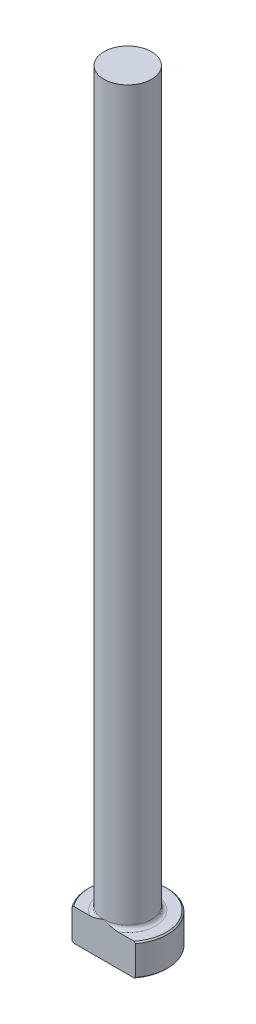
ISO-10303-21;
HEADER;
FILE_DESCRIPTION(('STEP AP214'),'2;1');
FILE_NAME('part.step','',(''),(''),'','','');
FILE_SCHEMA(('AUTOMOTIVE_DESIGN { 1 0 10303 214 1 1 1 1 }'));
ENDSEC;
DATA;
#1=APPLICATION_CONTEXT('core data for automotive mechanical design processes');
#2=APPLICATION_PROTOCOL_DEFINITION('international standard','automotive_design',2000,#1);
#3=PRODUCT_CONTEXT('',#1,'mechanical');
#4=PRODUCT('Part','Part','',(#3));
#5=PRODUCT_RELATED_PRODUCT_CATEGORY('part','',(#4));
#6=PRODUCT_DEFINITION_FORMATION('','',#4);
#7=PRODUCT_DEFINITION_CONTEXT('part definition',#1,'design');
#8=PRODUCT_DEFINITION('design','',#6,#7);
#9=PRODUCT_DEFINITION_SHAPE('','',#8);
#10=(LENGTH_UNIT() NAMED_UNIT(*) SI_UNIT(.MILLI.,.METRE.));
#11=(NAMED_UNIT(*) PLANE_ANGLE_UNIT() SI_UNIT($,.RADIAN.));
#12=(NAMED_UNIT(*) SI_UNIT($,.STERADIAN.) SOLID_ANGLE_UNIT());
#13=UNCERTAINTY_MEASURE_WITH_UNIT(LENGTH_MEASURE(1.E-05),#10,'distance_accuracy_value','');
#14=(GEOMETRIC_REPRESENTATION_CONTEXT(3) GLOBAL_UNCERTAINTY_ASSIGNED_CONTEXT((#13)) GLOBAL_UNIT_ASSIGNED_CONTEXT((#10,
#11,#12)) REPRESENTATION_CONTEXT('',''));
#15=CARTESIAN_POINT('',(0.,0.,0.));
#16=DIRECTION('',(0.,0.,1.));
#17=DIRECTION('',(1.,0.,0.));
#18=AXIS2_PLACEMENT_3D('',#15,#16,#17);
#19=CARTESIAN_POINT('',(0.,0.,0.));
#20=DIRECTION('',(0.,-1.,0.));
#21=DIRECTION('',(0.,0.,-1.));
#22=AXIS2_PLACEMENT_3D('',#19,#20,#21);
#23=PLANE('',#22);
#24=CARTESIAN_POINT('',(0.,0.,0.));
#25=DIRECTION('',(0.,-1.,0.));
#26=DIRECTION('',(0.,0.,-1.));
#27=AXIS2_PLACEMENT_3D('',#24,#25,#26);
#28=CIRCLE('',#27,7.68349999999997);
#29=CARTESIAN_POINT('',(-6.02949135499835,0.,4.76249999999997));
#30=VERTEX_POINT('',#29);
#31=CARTESIAN_POINT('',(6.02949135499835,0.,4.76249999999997));
#32=VERTEX_POINT('',#31);
#33=EDGE_CURVE('E98',#30,#32,#28,.T.);
#34=ORIENTED_EDGE('',*,*,#33,.T.);
#35=DIRECTION('',(-1.,0.,0.));
#36=VECTOR('',#35,1.);
#37=CARTESIAN_POINT('',(-6.34999999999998,0.,4.76249999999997));
#38=LINE('',#37,#36);
#39=EDGE_CURVE('E83',#32,#30,#38,.T.);
#40=ORIENTED_EDGE('',*,*,#39,.T.);
#41=EDGE_LOOP('',(#34,#40));
#42=FACE_BOUND('',#41,.T.);
#43=ADVANCED_FACE('F32',(#42),#23,.T.);
#44=CARTESIAN_POINT('',(0.,259.958771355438,0.));
#45=DIRECTION('',(0.,1.,0.));
#46=DIRECTION('',(0.,0.,1.));
#47=AXIS2_PLACEMENT_3D('',#44,#45,#46);
#48=CYLINDRICAL_SURFACE('',#47,7.93749999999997);
#49=CARTESIAN_POINT('',(0.,6.09600000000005,0.));
#50=DIRECTION('',(0.,1.,0.));
#51=DIRECTION('',(0.,0.,1.));
#52=AXIS2_PLACEMENT_3D('',#49,#50,#51);
#53=CIRCLE('',#52,7.93749999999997);
#54=CARTESIAN_POINT('',(-6.34999999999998,6.09600000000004,4.76249999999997));
#55=VERTEX_POINT('',#54);
#56=CARTESIAN_POINT('',(6.34999999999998,6.09600000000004,4.76249999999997));
#57=VERTEX_POINT('',#56);
#58=EDGE_CURVE('E104',#55,#57,#53,.F.);
#59=ORIENTED_EDGE('',*,*,#58,.T.);
#60=DIRECTION('',(0.,-1.,0.));
#61=VECTOR('',#60,1.);
#62=CARTESIAN_POINT('',(6.34999999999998,152.4,4.76249999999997));
#63=LINE('',#62,#61);
#64=CARTESIAN_POINT('',(6.34999999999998,0.253999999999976,4.76249999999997));
#65=VERTEX_POINT('',#64);
#66=EDGE_CURVE('E183',#57,#65,#63,.T.);
#67=ORIENTED_EDGE('',*,*,#66,.T.);
#68=CARTESIAN_POINT('',(0.,0.253999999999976,0.));
#69=DIRECTION('',(0.,-1.,0.));
#70=DIRECTION('',(0.,0.,-1.));
#71=AXIS2_PLACEMENT_3D('',#68,#69,#70);
#72=CIRCLE('',#71,7.93749999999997);
#73=CARTESIAN_POINT('',(-6.34999999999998,0.253999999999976,4.76249999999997));
#74=VERTEX_POINT('',#73);
#75=EDGE_CURVE('E100',#65,#74,#72,.F.);
#76=ORIENTED_EDGE('',*,*,#75,.T.);
#77=DIRECTION('',(0.,-1.,0.));
#78=VECTOR('',#77,1.);
#79=CARTESIAN_POINT('',(-6.34999999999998,152.4,4.76249999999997));
#80=LINE('',#79,#78);
#81=EDGE_CURVE('E93',#55,#74,#80,.T.);
#82=ORIENTED_EDGE('',*,*,#81,.F.);
#83=EDGE_LOOP('',(#59,#67,#76,#82));
#84=FACE_BOUND('',#83,.T.);
#85=ADVANCED_FACE('F158',(#84),#48,.T.);
#86=CARTESIAN_POINT('',(-7.93749999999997,6.35,0.));
#87=DIRECTION('',(0.,1.,0.));
#88=DIRECTION('',(0.,0.,1.));
#89=AXIS2_PLACEMENT_3D('',#86,#87,#88);
#90=PLANE('',#89);
#91=CARTESIAN_POINT('',(0.,6.35,0.));
#92=DIRECTION('',(0.,1.,0.));
#93=DIRECTION('',(0.,0.,1.));
#94=AXIS2_PLACEMENT_3D('',#91,#92,#93);
#95=CIRCLE('',#94,7.68350000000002);
#96=CARTESIAN_POINT('',(6.02949135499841,6.35,4.76249999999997));
#97=VERTEX_POINT('',#96);
#98=CARTESIAN_POINT('',(-6.02949135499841,6.35,4.76249999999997));
#99=VERTEX_POINT('',#98);
#100=EDGE_CURVE('E178',#97,#99,#95,.T.);
#101=ORIENTED_EDGE('',*,*,#100,.T.);
#102=DIRECTION('',(1.,0.,0.));
#103=VECTOR('',#102,1.);
#104=CARTESIAN_POINT('',(-7.93749999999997,6.35,4.76249999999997));
#105=LINE('',#104,#103);
#106=CARTESIAN_POINT('',(-2.79976677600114,6.35000000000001,4.76249999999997));
#107=VERTEX_POINT('',#106);
#108=EDGE_CURVE('E57',#99,#107,#105,.T.);
#109=ORIENTED_EDGE('',*,*,#108,.T.);
#110=CARTESIAN_POINT('',(0.,6.35,0.));
#111=DIRECTION('',(0.,1.,0.));
#112=DIRECTION('',(0.,0.,1.));
#113=AXIS2_PLACEMENT_3D('',#110,#111,#112);
#114=CIRCLE('',#113,5.52449999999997);
#115=CARTESIAN_POINT('',(2.79976677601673,6.35000000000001,4.76249999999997));
#116=VERTEX_POINT('',#115);
#117=EDGE_CURVE('E107',#107,#116,#114,.F.);
#118=ORIENTED_EDGE('',*,*,#117,.T.);
#119=EDGE_CURVE('E136',#116,#97,#105,.T.);
#120=ORIENTED_EDGE('',*,*,#119,.T.);
#121=EDGE_LOOP('',(#101,#109,#118,#120));
#122=FACE_BOUND('',#121,.T.);
#123=ADVANCED_FACE('F147',(#122),#90,.T.);
#124=CARTESIAN_POINT('',(0.,6.35000000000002,0.));
#125=DIRECTION('',(0.,-1.,0.));
#126=DIRECTION('',(0.,0.,-1.));
#127=AXIS2_PLACEMENT_3D('',#124,#125,#126);
#128=CONICAL_SURFACE('',#127,7.6835,0.785398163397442);
#129=ORIENTED_EDGE('',*,*,#58,.F.);
#130=CARTESIAN_POINT('',(-13.9717238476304,-0.727613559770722,4.76249999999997));
#131=CARTESIAN_POINT('',(-13.7440124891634,-0.512084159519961,4.76249999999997));
#132=CARTESIAN_POINT('',(-13.5160318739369,-0.296838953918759,4.76249999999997));
#133=CARTESIAN_POINT('',(-13.0594385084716,0.132982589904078,4.76249999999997));
#134=CARTESIAN_POINT('',(-12.8308257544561,0.347558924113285,4.76249999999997));
#135=CARTESIAN_POINT('',(-12.1433698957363,0.990628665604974,4.76249999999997));
#136=CARTESIAN_POINT('',(-11.683438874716,1.417960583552,4.76249999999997));
#137=CARTESIAN_POINT('',(-10.7398192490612,2.28660831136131,4.76249999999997));
#138=CARTESIAN_POINT('',(-10.2559580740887,2.72773732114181,4.76249999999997));
#139=CARTESIAN_POINT('',(-9.52579613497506,3.38404130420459,4.76249999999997));
#140=CARTESIAN_POINT('',(-9.28181372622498,3.60179461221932,4.76249999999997));
#141=CARTESIAN_POINT('',(-8.79195583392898,4.03515959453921,4.76249999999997));
#142=CARTESIAN_POINT('',(-8.54608036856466,4.25077128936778,4.76249999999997));
#143=CARTESIAN_POINT('',(-8.05235063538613,4.67899963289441,4.76249999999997));
#144=CARTESIAN_POINT('',(-7.80449972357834,4.89162014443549,4.76249999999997));
#145=CARTESIAN_POINT('',(-7.30587283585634,5.31343752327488,4.76249999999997));
#146=CARTESIAN_POINT('',(-7.05509670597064,5.52263420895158,4.76249999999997));
#147=CARTESIAN_POINT('',(-6.54895570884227,5.93726289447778,4.76249999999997));
#148=CARTESIAN_POINT('',(-6.29357776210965,6.14267898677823,4.76249999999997));
#149=CARTESIAN_POINT('',(-5.77806261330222,6.54738613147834,4.76249999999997));
#150=CARTESIAN_POINT('',(-5.51792616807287,6.74667814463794,4.76249999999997));
#151=CARTESIAN_POINT('',(-4.99669315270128,7.13290361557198,4.76249999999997));
#152=CARTESIAN_POINT('',(-4.7357228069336,7.3200056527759,4.76249999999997));
#153=CARTESIAN_POINT('',(-4.33820944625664,7.59205599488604,4.76249999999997));
#154=CARTESIAN_POINT('',(-4.20463607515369,7.68134253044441,4.76249999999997));
#155=CARTESIAN_POINT('',(-3.93520014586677,7.85638938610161,4.76249999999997));
#156=CARTESIAN_POINT('',(-3.79933771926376,7.94214990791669,4.76249999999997));
#157=CARTESIAN_POINT('',(-3.52582078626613,8.10887856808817,4.76249999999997));
#158=CARTESIAN_POINT('',(-3.38818211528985,8.18987258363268,4.76249999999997));
#159=CARTESIAN_POINT('',(-3.10994368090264,8.34667799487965,4.76249999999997));
#160=CARTESIAN_POINT('',(-2.96934354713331,8.42248873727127,4.76249999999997));
#161=CARTESIAN_POINT('',(-2.68509318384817,8.56758570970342,4.76249999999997));
#162=CARTESIAN_POINT('',(-2.54144841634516,8.63688258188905,4.76249999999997));
#163=CARTESIAN_POINT('',(-2.25062082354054,8.76758710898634,4.76249999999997));
#164=CARTESIAN_POINT('',(-2.10343915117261,8.8289972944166,4.76249999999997));
#165=CARTESIAN_POINT('',(-1.8843333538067,8.91218004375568,4.76249999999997));
#166=CARTESIAN_POINT('',(-1.81383186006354,8.93772120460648,4.76249999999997));
#167=CARTESIAN_POINT('',(-1.67202052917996,8.98645907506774,4.76249999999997));
#168=CARTESIAN_POINT('',(-1.60071065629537,9.00965568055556,4.76249999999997));
#169=CARTESIAN_POINT('',(-1.38555472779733,9.07542289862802,4.76249999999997));
#170=CARTESIAN_POINT('',(-1.24050522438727,9.11416209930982,4.76249999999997));
#171=CARTESIAN_POINT('',(-0.948515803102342,9.17953563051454,4.76249999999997));
#172=CARTESIAN_POINT('',(-0.801590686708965,9.20623542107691,4.76249999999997));
#173=CARTESIAN_POINT('',(-0.505930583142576,9.2464400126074,4.76249999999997));
#174=CARTESIAN_POINT('',(-0.357195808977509,9.25994635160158,4.76249999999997));
#175=CARTESIAN_POINT('',(-0.0580773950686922,9.27300540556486,4.76249999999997));
#176=CARTESIAN_POINT('',(0.0923105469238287,9.27246142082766,4.76249999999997));
#177=CARTESIAN_POINT('',(0.392354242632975,9.2572158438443,4.76249999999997));
#178=CARTESIAN_POINT('',(0.542009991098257,9.24251415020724,4.76249999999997));
#179=CARTESIAN_POINT('',(0.840076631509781,9.19973713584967,4.76249999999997));
#180=CARTESIAN_POINT('',(0.988478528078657,9.1716000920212,4.76249999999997));
#181=CARTESIAN_POINT('',(1.28250292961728,9.10341431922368,4.76249999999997));
#182=CARTESIAN_POINT('',(1.42812484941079,9.06336311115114,4.76249999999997));
#183=CARTESIAN_POINT('',(1.80157652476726,8.94630142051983,4.76249999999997));
#184=CARTESIAN_POINT('',(2.0269442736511,8.86145845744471,4.76249999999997));
#185=CARTESIAN_POINT('',(2.46947102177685,8.6725754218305,4.76249999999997));
#186=CARTESIAN_POINT('',(2.6866230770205,8.56851952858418,4.76249999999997));
#187=CARTESIAN_POINT('',(3.00782565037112,8.40144847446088,4.76249999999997));
#188=CARTESIAN_POINT('',(3.11463323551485,8.3436269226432,4.76249999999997));
#189=CARTESIAN_POINT('',(3.32653927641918,8.22492412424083,4.76249999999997));
#190=CARTESIAN_POINT('',(3.4316377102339,8.16404283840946,4.76249999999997));
#191=CARTESIAN_POINT('',(3.64022442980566,8.03970047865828,4.76249999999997));
#192=CARTESIAN_POINT('',(3.74371344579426,7.97624062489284,4.76249999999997));
#193=CARTESIAN_POINT('',(3.94927417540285,7.84708004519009,4.76249999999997));
#194=CARTESIAN_POINT('',(4.05134594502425,7.78137940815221,4.76249999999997));
#195=CARTESIAN_POINT('',(4.39010681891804,7.55875403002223,4.76249999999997));
#196=CARTESIAN_POINT('',(4.62396840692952,7.39752115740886,4.76249999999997));
#197=CARTESIAN_POINT('',(5.08629215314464,7.06746483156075,4.76249999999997));
#198=CARTESIAN_POINT('',(5.31475310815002,6.89863971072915,4.76249999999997));
#199=CARTESIAN_POINT('',(5.7675629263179,6.5552376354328,4.76249999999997));
#200=CARTESIAN_POINT('',(5.99190862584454,6.38065652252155,4.76249999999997));
#201=CARTESIAN_POINT('',(6.43717517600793,6.02723273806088,4.76249999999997));
#202=CARTESIAN_POINT('',(6.65809630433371,5.84839041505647,4.76249999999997));
#203=CARTESIAN_POINT('',(7.09790647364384,5.48680641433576,4.76249999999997));
#204=CARTESIAN_POINT('',(7.31678672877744,5.30405407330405,4.76249999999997));
#205=CARTESIAN_POINT('',(7.7523137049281,4.93590430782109,4.76249999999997));
#206=CARTESIAN_POINT('',(7.96896038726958,4.7505068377,4.76249999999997));
#207=CARTESIAN_POINT('',(8.4003252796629,4.37766695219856,4.76249999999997));
#208=CARTESIAN_POINT('',(8.61504426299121,4.19022543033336,4.76249999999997));
#209=CARTESIAN_POINT('',(9.04295707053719,3.81360841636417,4.76249999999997));
#210=CARTESIAN_POINT('',(9.25615088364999,3.62443291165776,4.76249999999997));
#211=CARTESIAN_POINT('',(9.85099823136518,3.09302727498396,4.76249999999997));
#212=CARTESIAN_POINT('',(10.2312296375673,2.74920552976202,4.76249999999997));
#213=CARTESIAN_POINT('',(10.9886755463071,2.0581727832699,4.76249999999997));
#214=CARTESIAN_POINT('',(11.3658896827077,1.71096138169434,4.76249999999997));
#215=CARTESIAN_POINT('',(12.1155837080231,1.0162434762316,4.76249999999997));
#216=CARTESIAN_POINT('',(12.4880784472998,0.668752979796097,4.76249999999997));
#217=CARTESIAN_POINT('',(13.2311819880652,-0.0281268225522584,4.76249999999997));
#218=CARTESIAN_POINT('',(13.6017910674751,-0.37751583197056,4.76249999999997));
#219=CARTESIAN_POINT('',(13.9717238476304,-0.727613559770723,4.76249999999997));
#220=B_SPLINE_CURVE_WITH_KNOTS('',3,(#130,#131,#132,#133,#134,#135,#136,#137,#138,#139,#140,
#141,#142,#143,#144,#145,#146,#147,#148,#149,#150,#151,#152,#153,#154,#155,#156,#157,#158,#159,
#160,#161,#162,#163,#164,#165,#166,#167,#168,#169,#170,#171,#172,#173,#174,#175,#176,#177,#178,
#179,#180,#181,#182,#183,#184,#185,#186,#187,#188,#189,#190,#191,#192,#193,#194,#195,#196,#197,
#198,#199,#200,#201,#202,#203,#204,#205,#206,#207,#208,#209,#210,#211,#212,#213,#214,#215,#216,
#217,#218,#219),.UNSPECIFIED.,.F.,.F.,(4,2,2,2,2,2,2,2,2,2,2,2,2,2,2,2,2,2,2,2,2,2,2,2,2,2,2,2,
2,2,2,2,2,2,2,2,2,2,2,2,2,2,2,2,4),(0.,0.940610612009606,1.88122685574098,3.76464908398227,
5.72889030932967,6.70994924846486,7.69099877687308,8.67063680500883,9.6503266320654,
10.6334769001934,11.616472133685,12.5795523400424,13.0615108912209,13.5434418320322,
14.0224542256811,14.5015268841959,14.9798027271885,15.457924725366,15.6828447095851,
15.9077746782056,16.3577079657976,16.8051644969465,17.2525688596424,17.7030532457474,
18.1535408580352,18.6061182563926,19.0587898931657,19.7799130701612,20.5016327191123,
20.8659558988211,21.2302837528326,21.5944411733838,21.9585841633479,22.8105074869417,
23.6626188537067,24.5153599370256,25.3680315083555,26.2234368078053,27.0788568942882,
27.9339169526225,28.788983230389,30.3268416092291,31.8648838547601,33.3931161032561,
34.9211161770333),.UNSPECIFIED.);
#221=EDGE_CURVE('E135',#55,#99,#220,.T.);
#222=ORIENTED_EDGE('',*,*,#221,.T.);
#223=ORIENTED_EDGE('',*,*,#100,.F.);
#224=EDGE_CURVE('E127',#97,#57,#220,.T.);
#225=ORIENTED_EDGE('',*,*,#224,.T.);
#226=EDGE_LOOP('',(#129,#222,#223,#225));
#227=FACE_BOUND('',#226,.T.);
#228=ADVANCED_FACE('F143',(#227),#128,.T.);
#229=CARTESIAN_POINT('',(0.,0.253999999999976,0.));
#230=DIRECTION('',(0.,1.,0.));
#231=DIRECTION('',(0.,0.,1.));
#232=AXIS2_PLACEMENT_3D('',#229,#230,#231);
#233=CONICAL_SURFACE('',#232,7.93749999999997,0.785398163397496);
#234=ORIENTED_EDGE('',*,*,#75,.F.);
#235=CARTESIAN_POINT('',(13.9717238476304,7.07761355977,4.76249999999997));
#236=CARTESIAN_POINT('',(13.7440124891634,6.86208415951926,4.76249999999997));
#237=CARTESIAN_POINT('',(13.5160318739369,6.64683895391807,4.76249999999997));
#238=CARTESIAN_POINT('',(13.0594385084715,6.21701741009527,4.76249999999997));
#239=CARTESIAN_POINT('',(12.8308257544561,6.00244107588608,4.76249999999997));
#240=CARTESIAN_POINT('',(12.1433698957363,5.35937133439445,4.76249999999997));
#241=CARTESIAN_POINT('',(11.6834388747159,4.93203941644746,4.76249999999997));
#242=CARTESIAN_POINT('',(10.7398192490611,4.06339168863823,4.76249999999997));
#243=CARTESIAN_POINT('',(10.2559580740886,3.62226267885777,4.76249999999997));
#244=CARTESIAN_POINT('',(9.52579613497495,2.96595869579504,4.76249999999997));
#245=CARTESIAN_POINT('',(9.28181372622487,2.74820538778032,4.76249999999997));
#246=CARTESIAN_POINT('',(8.79195583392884,2.31484040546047,4.76249999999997));
#247=CARTESIAN_POINT('',(8.54608036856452,2.09922871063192,4.76249999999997));
#248=CARTESIAN_POINT('',(8.05235063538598,1.67100036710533,4.76249999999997));
#249=CARTESIAN_POINT('',(7.80449972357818,1.45837985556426,4.76249999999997));
#250=CARTESIAN_POINT('',(7.30587283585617,1.03656247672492,4.76249999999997));
#251=CARTESIAN_POINT('',(7.05509670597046,0.827365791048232,4.76249999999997));
#252=CARTESIAN_POINT('',(6.54895570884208,0.412737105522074,4.76249999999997));
#253=CARTESIAN_POINT('',(6.29357776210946,0.207321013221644,4.76249999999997));
#254=CARTESIAN_POINT('',(5.77806261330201,-0.197386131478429,4.76249999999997));
#255=CARTESIAN_POINT('',(5.51792616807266,-0.396678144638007,4.76249999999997));
#256=CARTESIAN_POINT('',(4.99669315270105,-0.782903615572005,4.76249999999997));
#257=CARTESIAN_POINT('',(4.73572280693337,-0.970005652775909,4.76249999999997));
#258=CARTESIAN_POINT('',(4.3382094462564,-1.24205599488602,4.76249999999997));
#259=CARTESIAN_POINT('',(4.20463607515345,-1.33134253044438,4.76249999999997));
#260=CARTESIAN_POINT('',(3.93520014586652,-1.50638938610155,4.76249999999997));
#261=CARTESIAN_POINT('',(3.79933771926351,-1.59214990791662,4.76249999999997));
#262=CARTESIAN_POINT('',(3.52582078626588,-1.75887856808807,4.76249999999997));
#263=CARTESIAN_POINT('',(3.3881821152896,-1.83987258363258,4.76249999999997));
#264=CARTESIAN_POINT('',(3.10994368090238,-1.99667799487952,4.76249999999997));
#265=CARTESIAN_POINT('',(2.96934354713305,-2.07248873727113,4.76249999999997));
#266=CARTESIAN_POINT('',(2.68509318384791,-2.21758570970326,4.76249999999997));
#267=CARTESIAN_POINT('',(2.5414484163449,-2.28688258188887,4.76249999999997));
#268=CARTESIAN_POINT('',(2.25062082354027,-2.41758710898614,4.76249999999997));
#269=CARTESIAN_POINT('',(2.10343915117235,-2.47899729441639,4.76249999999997));
#270=CARTESIAN_POINT('',(1.88433335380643,-2.56218004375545,4.76249999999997));
#271=CARTESIAN_POINT('',(1.81383186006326,-2.58772120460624,4.76249999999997));
#272=CARTESIAN_POINT('',(1.67202052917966,-2.63645907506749,4.76249999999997));
#273=CARTESIAN_POINT('',(1.60071065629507,-2.65965568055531,4.76249999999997));
#274=CARTESIAN_POINT('',(1.38555472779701,-2.72542289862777,4.76249999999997));
#275=CARTESIAN_POINT('',(1.24050522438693,-2.76416209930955,4.76249999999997));
#276=CARTESIAN_POINT('',(0.94851580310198,-2.82953563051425,4.76249999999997));
#277=CARTESIAN_POINT('',(0.80159068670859,-2.85623542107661,4.76249999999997));
#278=CARTESIAN_POINT('',(0.505930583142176,-2.89644001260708,4.76249999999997));
#279=CARTESIAN_POINT('',(0.357195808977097,-2.90994635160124,4.76249999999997));
#280=CARTESIAN_POINT('',(0.0580773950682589,-2.9230054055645,4.76249999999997));
#281=CARTESIAN_POINT('',(-0.0923105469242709,-2.92246142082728,4.76249999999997));
#282=CARTESIAN_POINT('',(-0.392354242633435,-2.90721584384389,4.76249999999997));
#283=CARTESIAN_POINT('',(-0.542009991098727,-2.89251415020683,4.76249999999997));
#284=CARTESIAN_POINT('',(-0.840076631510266,-2.84973713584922,4.76249999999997));
#285=CARTESIAN_POINT('',(-0.988478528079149,-2.82160009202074,4.76249999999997));
#286=CARTESIAN_POINT('',(-1.28250292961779,-2.75341431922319,4.76249999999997));
#287=CARTESIAN_POINT('',(-1.42812484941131,-2.71336311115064,4.76249999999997));
#288=CARTESIAN_POINT('',(-1.80157652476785,-2.59630142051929,4.76249999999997));
#289=CARTESIAN_POINT('',(-2.02694427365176,-2.51145845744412,4.76249999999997));
#290=CARTESIAN_POINT('',(-2.46947102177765,-2.32257542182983,4.76249999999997));
#291=CARTESIAN_POINT('',(-2.68662307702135,-2.21851952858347,4.76249999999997));
#292=CARTESIAN_POINT('',(-3.00782565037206,-2.0514484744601,4.76249999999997));
#293=CARTESIAN_POINT('',(-3.11463323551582,-1.9936269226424,4.76249999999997));
#294=CARTESIAN_POINT('',(-3.32653927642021,-1.87492412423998,4.76249999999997));
#295=CARTESIAN_POINT('',(-3.43163771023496,-1.81404283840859,4.76249999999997));
#296=CARTESIAN_POINT('',(-3.64022442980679,-1.68970047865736,4.76249999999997));
#297=CARTESIAN_POINT('',(-3.74371344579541,-1.6262406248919,4.76249999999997));
#298=CARTESIAN_POINT('',(-3.94927417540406,-1.4970800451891,4.76249999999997));
#299=CARTESIAN_POINT('',(-4.05134594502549,-1.4313794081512,4.76249999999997));
#300=CARTESIAN_POINT('',(-4.39010681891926,-1.20875403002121,4.76249999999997));
#301=CARTESIAN_POINT('',(-4.6239684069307,-1.04752115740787,4.76249999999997));
#302=CARTESIAN_POINT('',(-5.08629215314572,-0.717464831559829,4.76249999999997));
#303=CARTESIAN_POINT('',(-5.31475310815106,-0.548639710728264,4.76249999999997));
#304=CARTESIAN_POINT('',(-5.76756292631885,-0.205237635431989,4.76249999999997));
#305=CARTESIAN_POINT('',(-5.99190862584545,-0.0306565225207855,4.76249999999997));
#306=CARTESIAN_POINT('',(-6.43717517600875,0.322767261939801,4.76249999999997));
#307=CARTESIAN_POINT('',(-6.65809630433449,0.501609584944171,4.76249999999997));
#308=CARTESIAN_POINT('',(-7.09790647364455,0.863193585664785,4.76249999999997));
#309=CARTESIAN_POINT('',(-7.3167867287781,1.04594592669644,4.76249999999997));
#310=CARTESIAN_POINT('',(-7.75231370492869,1.41409569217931,4.76249999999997));
#311=CARTESIAN_POINT('',(-7.96896038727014,1.59949316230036,4.76249999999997));
#312=CARTESIAN_POINT('',(-8.40032527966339,1.9723330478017,4.76249999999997));
#313=CARTESIAN_POINT('',(-8.61504426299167,2.15977456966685,4.76249999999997));
#314=CARTESIAN_POINT('',(-9.04295707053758,2.53639158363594,4.76249999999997));
#315=CARTESIAN_POINT('',(-9.25615088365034,2.72556708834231,4.76249999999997));
#316=CARTESIAN_POINT('',(-9.85099823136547,3.25697272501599,4.76249999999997));
#317=CARTESIAN_POINT('',(-10.2312296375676,3.60079447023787,4.76249999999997));
#318=CARTESIAN_POINT('',(-10.9886755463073,4.29182721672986,4.76249999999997));
#319=CARTESIAN_POINT('',(-11.3658896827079,4.63903861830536,4.76249999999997));
#320=CARTESIAN_POINT('',(-12.1155837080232,5.33375652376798,4.76249999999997));
#321=CARTESIAN_POINT('',(-12.4880784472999,5.68124702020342,4.76249999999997));
#322=CARTESIAN_POINT('',(-13.2311819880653,6.37812682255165,4.76249999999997));
#323=CARTESIAN_POINT('',(-13.6017910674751,6.72751583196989,4.76249999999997));
#324=CARTESIAN_POINT('',(-13.9717238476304,7.07761355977,4.76249999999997));
#325=B_SPLINE_CURVE_WITH_KNOTS('',3,(#235,#236,#237,#238,#239,#240,#241,#242,#243,#244,#245,
#246,#247,#248,#249,#250,#251,#252,#253,#254,#255,#256,#257,#258,#259,#260,#261,#262,#263,#264,
#265,#266,#267,#268,#269,#270,#271,#272,#273,#274,#275,#276,#277,#278,#279,#280,#281,#282,#283,
#284,#285,#286,#287,#288,#289,#290,#291,#292,#293,#294,#295,#296,#297,#298,#299,#300,#301,#302,
#303,#304,#305,#306,#307,#308,#309,#310,#311,#312,#313,#314,#315,#316,#317,#318,#319,#320,#321,
#322,#323,#324),.UNSPECIFIED.,.F.,.F.,(4,2,2,2,2,2,2,2,2,2,2,2,2,2,2,2,2,2,2,2,2,2,2,2,2,2,2,2,
2,2,2,2,2,2,2,2,2,2,2,2,2,2,2,2,4),(0.,0.94061061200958,1.88122685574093,3.76464908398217,
5.72889030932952,6.70994924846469,7.69099877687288,8.67063680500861,9.65032663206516,
10.6334769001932,11.6164721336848,12.5795523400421,13.0615108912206,13.5434418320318,
14.0224542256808,14.5015268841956,14.9798027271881,15.4579247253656,15.6828447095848,
15.9077746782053,16.3577079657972,16.8051644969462,17.2525688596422,17.7030532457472,
18.153540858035,18.6061182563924,19.0587898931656,19.7799130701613,20.5016327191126,
20.8659558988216,21.2302837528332,21.5944411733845,21.9585841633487,22.8105074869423,
23.6626188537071,24.5153599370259,25.3680315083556,26.2234368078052,27.078856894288,
27.933916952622,28.7889832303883,30.3268416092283,31.8648838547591,33.3931161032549,
34.9211161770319),.UNSPECIFIED.);
#326=EDGE_CURVE('E86',#65,#32,#325,.T.);
#327=ORIENTED_EDGE('',*,*,#326,.T.);
#328=ORIENTED_EDGE('',*,*,#33,.F.);
#329=EDGE_CURVE('E89',#30,#74,#325,.T.);
#330=ORIENTED_EDGE('',*,*,#329,.T.);
#331=EDGE_LOOP('',(#234,#327,#328,#330));
#332=FACE_BOUND('',#331,.T.);
#333=ADVANCED_FACE('F97',(#332),#233,.T.);
#334=CARTESIAN_POINT('',(0.,7.11200000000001,0.));
#335=DIRECTION('',(0.,1.,0.));
#336=DIRECTION('',(0.,0.,1.));
#337=AXIS2_PLACEMENT_3D('',#334,#335,#336);
#338=TOROIDAL_SURFACE('',#337,5.52449999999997,0.762);
#339=CARTESIAN_POINT('',(0.,7.11200000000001,4.76249999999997));
#340=CARTESIAN_POINT('',(1.75716832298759E-10,7.1120009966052,4.76249999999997));
#341=CARTESIAN_POINT('',(2.11716128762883E-07,7.11200199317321,4.76249999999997));
#342=CARTESIAN_POINT('',(8.80753956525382E-07,7.11200391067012,4.76249999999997));
#343=CARTESIAN_POINT('',(1.34491796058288E-06,7.11200482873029,4.76249999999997));
#344=CARTESIAN_POINT('',(2.45982947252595E-06,7.11200666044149,4.76249999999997));
#345=CARTESIAN_POINT('',(3.12384157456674E-06,7.11200756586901,4.76249999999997));
#346=CARTESIAN_POINT('',(4.55507944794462E-06,7.11200927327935,4.76249999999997));
#347=CARTESIAN_POINT('',(5.32136303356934E-06,7.11201007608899,4.76249999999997));
#348=CARTESIAN_POINT('',(8.07192926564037E-06,7.11201277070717,4.76249999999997));
#349=CARTESIAN_POINT('',(1.01901643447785E-05,7.11201452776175,4.76249999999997));
#350=CARTESIAN_POINT('',(1.45651591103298E-05,7.11201765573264,4.76249999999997));
#351=CARTESIAN_POINT('',(1.68139274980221E-05,7.11201903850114,4.76249999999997));
#352=CARTESIAN_POINT('',(2.56002968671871E-05,7.11202424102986,4.76249999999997));
#353=CARTESIAN_POINT('',(3.23057719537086E-05,7.11202779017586,4.76249999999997));
#354=CARTESIAN_POINT('',(4.55210144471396E-05,7.11203358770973,4.76249999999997));
#355=CARTESIAN_POINT('',(5.19929180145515E-05,7.11203592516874,4.76249999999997));
#356=CARTESIAN_POINT('',(7.95921607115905E-05,7.1120458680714,4.76249999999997));
#357=CARTESIAN_POINT('',(0.00010072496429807,7.11205341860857,4.76249999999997));
#358=CARTESIAN_POINT('',(0.000140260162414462,7.11206552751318,4.76249999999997));
#359=CARTESIAN_POINT('',(0.000158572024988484,7.11207036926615,4.76249999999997));
#360=CARTESIAN_POINT('',(0.000291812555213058,7.11210874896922,4.76249999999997));
#361=CARTESIAN_POINT('',(0.000401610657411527,7.11215771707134,4.76249999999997));
#362=CARTESIAN_POINT('',(0.00082873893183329,7.11234123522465,4.76249999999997));
#363=CARTESIAN_POINT('',(0.0011496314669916,7.11246431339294,4.76249999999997));
#364=CARTESIAN_POINT('',(0.00239628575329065,7.11294956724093,4.76249999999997));
#365=CARTESIAN_POINT('',(0.00331839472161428,7.11332376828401,4.76249999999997));
#366=CARTESIAN_POINT('',(0.00709602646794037,7.11484953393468,4.76249999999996));
#367=CARTESIAN_POINT('',(0.00995556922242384,7.11598757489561,4.76249999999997));
#368=CARTESIAN_POINT('',(0.0776380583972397,7.14293320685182,4.76250000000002));
#369=CARTESIAN_POINT('',(0.142407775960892,7.16892226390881,4.76249999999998));
#370=CARTESIAN_POINT('',(0.269647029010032,7.21961897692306,4.76249999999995));
#371=CARTESIAN_POINT('',(0.332112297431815,7.24433828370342,4.76249999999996));
#372=CARTESIAN_POINT('',(0.464537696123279,7.29630170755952,4.76249999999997));
#373=CARTESIAN_POINT('',(0.534515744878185,7.32350106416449,4.76249999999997));
#374=CARTESIAN_POINT('',(0.675480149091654,7.37742387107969,4.76249999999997));
#375=CARTESIAN_POINT('',(0.746469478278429,7.40413956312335,4.76249999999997));
#376=CARTESIAN_POINT('',(0.870073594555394,7.44962494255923,4.76249999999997));
#377=CARTESIAN_POINT('',(0.922600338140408,7.46863321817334,4.76249999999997));
#378=CARTESIAN_POINT('',(1.0277692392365,7.50591527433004,4.76249999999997));
#379=CARTESIAN_POINT('',(1.08041080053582,7.52419073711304,4.76249999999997));
#380=CARTESIAN_POINT('',(1.23635883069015,7.57699196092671,4.76249999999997));
#381=CARTESIAN_POINT('',(1.34005657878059,7.61037532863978,4.76249999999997));
#382=CARTESIAN_POINT('',(1.56359060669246,7.67746997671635,4.76249999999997));
#383=CARTESIAN_POINT('',(1.68362015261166,7.71054957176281,4.76249999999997));
#384=CARTESIAN_POINT('',(1.92642555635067,7.76967498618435,4.76249999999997));
#385=CARTESIAN_POINT('',(2.04921557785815,7.79566353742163,4.76249999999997));
#386=CARTESIAN_POINT('',(2.30422797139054,7.83918726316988,4.76249999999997));
#387=CARTESIAN_POINT('',(2.43656426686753,7.85610069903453,4.76249999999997));
#388=CARTESIAN_POINT('',(2.63563546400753,7.8702758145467,4.76249999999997));
#389=CARTESIAN_POINT('',(2.70197039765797,7.87313972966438,4.76249999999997));
#390=CARTESIAN_POINT('',(2.83467605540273,7.87452977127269,4.76249999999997));
#391=CARTESIAN_POINT('',(2.90104677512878,7.87305634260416,4.76249999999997));
#392=CARTESIAN_POINT('',(3.06624711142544,7.86305254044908,4.76249999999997));
#393=CARTESIAN_POINT('',(3.1649502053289,7.85140164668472,4.76249999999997));
#394=CARTESIAN_POINT('',(3.3102514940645,7.82310986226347,4.76249999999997));
#395=CARTESIAN_POINT('',(3.35793795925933,7.81197880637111,4.76249999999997));
#396=CARTESIAN_POINT('',(3.45215770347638,7.78564548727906,4.76249999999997));
#397=CARTESIAN_POINT('',(3.49869187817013,7.77044650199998,4.76249999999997));
#398=CARTESIAN_POINT('',(3.59306902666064,7.73421407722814,4.76249999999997));
#399=CARTESIAN_POINT('',(3.64079022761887,7.71285751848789,4.76249999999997));
#400=CARTESIAN_POINT('',(3.73313951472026,7.66398014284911,4.76249999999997));
#401=CARTESIAN_POINT('',(3.77776331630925,7.63645100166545,4.76249999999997));
#402=CARTESIAN_POINT('',(3.8538778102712,7.58041326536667,4.76249999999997));
#403=CARTESIAN_POINT('',(3.88624519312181,7.55310714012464,4.76249999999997));
#404=CARTESIAN_POINT('',(3.94622799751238,7.49369496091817,4.76249999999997));
#405=CARTESIAN_POINT('',(3.97385320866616,7.46159905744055,4.76249999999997));
#406=CARTESIAN_POINT('',(4.01655184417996,7.4011650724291,4.76249999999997));
#407=CARTESIAN_POINT('',(4.03304226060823,7.37383278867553,4.76249999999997));
#408=CARTESIAN_POINT('',(4.06135260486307,7.31682811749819,4.76249999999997));
#409=CARTESIAN_POINT('',(4.07317539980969,7.28715718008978,4.76249999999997));
#410=CARTESIAN_POINT('',(4.09136459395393,7.22592510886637,4.76249999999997));
#411=CARTESIAN_POINT('',(4.09769076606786,7.19435181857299,4.76249999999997));
#412=CARTESIAN_POINT('',(4.10417375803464,7.13057793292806,4.76249999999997));
#413=CARTESIAN_POINT('',(4.10433369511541,7.0983776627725,4.76249999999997));
#414=CARTESIAN_POINT('',(4.09881588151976,7.03816798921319,4.76249999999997));
#415=CARTESIAN_POINT('',(4.09379438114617,7.01009545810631,4.76249999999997));
#416=CARTESIAN_POINT('',(4.07925766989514,6.95514890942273,4.76249999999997));
#417=CARTESIAN_POINT('',(4.06974176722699,6.92827507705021,4.76249999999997));
#418=CARTESIAN_POINT('',(4.04639465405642,6.87537805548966,4.76249999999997));
#419=CARTESIAN_POINT('',(4.03242569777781,6.84941634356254,4.76249999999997));
#420=CARTESIAN_POINT('',(4.00102190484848,6.79970293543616,4.76249999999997));
#421=CARTESIAN_POINT('',(3.98358563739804,6.77595215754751,4.76249999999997));
#422=CARTESIAN_POINT('',(3.93494606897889,6.71761387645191,4.76249999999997));
#423=CARTESIAN_POINT('',(3.90164076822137,6.68477550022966,4.76249999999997));
#424=CARTESIAN_POINT('',(3.83023707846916,6.62476083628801,4.76249999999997));
#425=CARTESIAN_POINT('',(3.79212391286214,6.59760272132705,4.76249999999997));
#426=CARTESIAN_POINT('',(3.69123876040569,6.53519525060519,4.76249999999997));
#427=CARTESIAN_POINT('',(3.62627547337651,6.5035096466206,4.76249999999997));
#428=CARTESIAN_POINT('',(3.49255240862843,6.45041788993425,4.76249999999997));
#429=CARTESIAN_POINT('',(3.42379589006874,6.42900306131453,4.76249999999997));
#430=CARTESIAN_POINT('',(3.29415895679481,6.39697273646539,4.76249999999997));
#431=CARTESIAN_POINT('',(3.23354049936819,6.38525800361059,4.76249999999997));
#432=CARTESIAN_POINT('',(3.11149484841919,6.36705546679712,4.76249999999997));
#433=CARTESIAN_POINT('',(3.05006701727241,6.36057206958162,4.76249999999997));
#434=CARTESIAN_POINT('',(2.92589148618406,6.35201311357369,4.76249999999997));
#435=CARTESIAN_POINT('',(2.86313887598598,6.35001297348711,4.76249999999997));
#436=CARTESIAN_POINT('',(2.73768820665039,6.34998716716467,4.76249999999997));
#437=CARTESIAN_POINT('',(2.67499013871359,6.35195889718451,4.76249999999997));
#438=CARTESIAN_POINT('',(2.52932457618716,6.3605299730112,4.76249999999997));
#439=CARTESIAN_POINT('',(2.44643477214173,6.36843196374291,4.76249999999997));
#440=CARTESIAN_POINT('',(2.28127175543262,6.38922870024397,4.76249999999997));
#441=CARTESIAN_POINT('',(2.19899884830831,6.40212577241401,4.76249999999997));
#442=CARTESIAN_POINT('',(1.95269348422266,6.44712458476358,4.76249999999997));
#443=CARTESIAN_POINT('',(1.78980549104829,6.48548332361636,4.76249999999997));
#444=CARTESIAN_POINT('',(1.48033682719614,6.56994207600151,4.76249999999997));
#445=CARTESIAN_POINT('',(1.33350347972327,6.61516405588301,4.76249999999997));
#446=CARTESIAN_POINT('',(1.04345459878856,6.71161170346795,4.76249999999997));
#447=CARTESIAN_POINT('',(0.90021766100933,6.76277370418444,4.76249999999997));
#448=CARTESIAN_POINT('',(0.704750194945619,6.83559047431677,4.76249999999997));
#449=CARTESIAN_POINT('',(0.651886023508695,6.85558735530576,4.76249999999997));
#450=CARTESIAN_POINT('',(0.544940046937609,6.89652727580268,4.76249999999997));
#451=CARTESIAN_POINT('',(0.490862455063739,6.91748138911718,4.76249999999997));
#452=CARTESIAN_POINT('',(0.39954559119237,6.95317215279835,4.76249999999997));
#453=CARTESIAN_POINT('',(0.362273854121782,6.9678263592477,4.76249999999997));
#454=CARTESIAN_POINT('',(0.288146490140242,6.99710466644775,4.76249999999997));
#455=CARTESIAN_POINT('',(0.251290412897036,7.01172761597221,4.76249999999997));
#456=CARTESIAN_POINT('',(0.181451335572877,7.03949988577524,4.76249999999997));
#457=CARTESIAN_POINT('',(0.148465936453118,7.05264357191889,4.76249999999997));
#458=CARTESIAN_POINT('',(0.0812672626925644,7.07951218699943,4.76249999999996));
#459=CARTESIAN_POINT('',(0.047055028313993,7.09324020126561,4.76249999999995));
#460=CARTESIAN_POINT('',(0.00995870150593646,7.10801136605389,4.76249999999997));
#461=CARTESIAN_POINT('',(0.00710220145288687,7.10914804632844,4.76249999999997));
#462=CARTESIAN_POINT('',(0.00332530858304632,7.11067346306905,4.76249999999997));
#463=CARTESIAN_POINT('',(0.00240087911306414,7.11104861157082,4.76249999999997));
#464=CARTESIAN_POINT('',(0.00115127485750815,7.11153501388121,4.76249999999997));
#465=CARTESIAN_POINT('',(0.000829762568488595,7.11165833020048,4.76249999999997));
#466=CARTESIAN_POINT('',(0.000401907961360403,7.11184216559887,4.76249999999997));
#467=CARTESIAN_POINT('',(0.000291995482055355,7.11189118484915,4.76249999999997));
#468=CARTESIAN_POINT('',(0.000158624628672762,7.11192959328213,4.76249999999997));
#469=CARTESIAN_POINT('',(0.000140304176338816,7.11193443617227,4.76249999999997));
#470=CARTESIAN_POINT('',(0.000100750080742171,7.11194655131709,4.76249999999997));
#471=CARTESIAN_POINT('',(7.96072019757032E-05,7.11195410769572,4.76249999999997));
#472=CARTESIAN_POINT('',(5.19966523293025E-05,7.11196405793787,4.76249999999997));
#473=CARTESIAN_POINT('',(4.55234098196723E-05,7.111966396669,4.76249999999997));
#474=CARTESIAN_POINT('',(3.23056444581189E-05,7.11197219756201,4.76249999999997));
#475=CARTESIAN_POINT('',(2.55990344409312E-05,7.1119757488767,4.76249999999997));
#476=CARTESIAN_POINT('',(1.68115970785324E-05,7.11198095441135,4.76249999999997));
#477=CARTESIAN_POINT('',(1.45627239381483E-05,7.11198233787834,4.76249999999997));
#478=CARTESIAN_POINT('',(1.0187658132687E-05,7.11198546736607,4.76249999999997));
#479=CARTESIAN_POINT('',(8.06946385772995E-06,7.11198722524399,4.76249999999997));
#480=CARTESIAN_POINT('',(5.31911933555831E-06,7.11198992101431,4.76249999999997));
#481=CARTESIAN_POINT('',(4.55293264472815E-06,7.11199072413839,4.76249999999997));
#482=CARTESIAN_POINT('',(3.1219448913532E-06,7.11199243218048,4.76249999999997));
#483=CARTESIAN_POINT('',(2.45808665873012E-06,7.11199333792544,4.76249999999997));
#484=CARTESIAN_POINT('',(1.34354728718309E-06,7.11199517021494,4.76249999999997));
#485=CARTESIAN_POINT('',(8.79593870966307E-07,7.11199608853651,4.76249999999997));
#486=CARTESIAN_POINT('',(2.11067517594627E-07,7.11199800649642,4.76249999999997));
#487=CARTESIAN_POINT('',(-1.75739402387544E-10,7.11199900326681,4.76249999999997));
#488=CARTESIAN_POINT('',(0.,7.11200000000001,4.76249999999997));
#489=B_SPLINE_CURVE_WITH_KNOTS('',3,(#339,#340,#341,#342,#343,#344,#345,#346,#347,#348,#349,
#350,#351,#352,#353,#354,#355,#356,#357,#358,#359,#360,#361,#362,#363,#364,#365,#366,#367,#368,
#369,#370,#371,#372,#373,#374,#375,#376,#377,#378,#379,#380,#381,#382,#383,#384,#385,#386,#387,
#388,#389,#390,#391,#392,#393,#394,#395,#396,#397,#398,#399,#400,#401,#402,#403,#404,#405,#406,
#407,#408,#409,#410,#411,#412,#413,#414,#415,#416,#417,#418,#419,#420,#421,#422,#423,#424,#425,
#426,#427,#428,#429,#430,#431,#432,#433,#434,#435,#436,#437,#438,#439,#440,#441,#442,#443,#444,
#445,#446,#447,#448,#449,#450,#451,#452,#453,#454,#455,#456,#457,#458,#459,#460,#461,#462,#463,
#464,#465,#466,#467,#468,#469,#470,#471,#472,#473,#474,#475,#476,#477,#478,#479,#480,#481,#482,
#483,#484,#485,#486,#487,#488),.UNSPECIFIED.,.T.,.F.,(4,2,2,2,2,2,2,2,2,2,2,2,2,2,2,2,2,2,2,2,2,
2,2,2,2,2,2,2,2,2,2,2,2,2,2,2,2,2,2,2,2,2,2,2,2,2,2,2,2,2,2,2,2,2,2,2,2,2,2,2,2,2,2,2,2,2,2,2,2,
2,2,2,2,2,4),(0.,2.98829250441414E-06,6.05956346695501E-06,9.41423009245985E-06,
1.27398874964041E-05,2.09563298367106E-05,2.88697100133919E-05,5.15590449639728E-05,
7.21804383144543E-05,0.000139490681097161,0.00019626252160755,0.000555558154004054,
0.00158774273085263,0.00457176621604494,0.0138062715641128,0.223151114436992,0.424691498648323,
0.649921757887,0.877465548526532,1.0450421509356,1.21220902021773,1.53896422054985,
1.91230059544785,2.28856838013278,2.68809156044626,2.8871575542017,3.08620313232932,
3.38336261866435,3.53012668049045,3.67677283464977,3.83326124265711,3.98996197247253,
4.11658185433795,4.24293711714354,4.33833631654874,4.4336768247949,4.52970934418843,
4.62569331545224,4.710853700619,4.79602719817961,4.88414369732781,4.97229663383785,
5.11181296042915,5.25176903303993,5.46739168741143,5.68283187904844,5.86779164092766,
6.05290704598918,6.24111386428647,6.42919734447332,6.67879819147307,6.92851542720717,
7.42983936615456,7.89058054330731,8.34677385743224,8.51633402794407,8.69031772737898,
8.81046509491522,8.92941700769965,9.03594279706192,9.14652227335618,9.15574682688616,
9.15873836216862,9.15977254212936,9.16013221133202,9.16018900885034,9.16025635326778,
9.16027697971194,9.16029967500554,9.16030758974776,9.16031580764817,9.16031913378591,
9.1603224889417,9.16032556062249,9.16032854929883),.UNSPECIFIED.);
#490=CARTESIAN_POINT('',(0.,7.11200000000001,4.76249999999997));
#491=VERTEX_POINT('',#490);
#492=EDGE_CURVE('E11',#116,#491,#489,.T.);
#493=ORIENTED_EDGE('',*,*,#492,.F.);
#494=ORIENTED_EDGE('',*,*,#117,.F.);
#495=CARTESIAN_POINT('',(0.,7.11200000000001,4.76249999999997));
#496=CARTESIAN_POINT('',(-1.75715613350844E-10,7.11199900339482,4.76249999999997));
#497=CARTESIAN_POINT('',(-2.11716126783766E-07,7.11199800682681,4.76249999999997));
#498=CARTESIAN_POINT('',(-8.80753953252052E-07,7.1119960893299,4.76249999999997));
#499=CARTESIAN_POINT('',(-1.34491795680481E-06,7.11199517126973,4.76249999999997));
#500=CARTESIAN_POINT('',(-2.45982946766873E-06,7.11199333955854,4.76249999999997));
#501=CARTESIAN_POINT('',(-3.12384156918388E-06,7.11199243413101,4.76249999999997));
#502=CARTESIAN_POINT('',(-4.55507944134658E-06,7.11199072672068,4.76249999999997));
#503=CARTESIAN_POINT('',(-5.32136302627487E-06,7.11198992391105,4.76249999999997));
#504=CARTESIAN_POINT('',(-8.07192925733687E-06,7.11198722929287,4.76249999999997));
#505=CARTESIAN_POINT('',(-1.01901643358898E-05,7.11198547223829,4.76249999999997));
#506=CARTESIAN_POINT('',(-1.45651590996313E-05,7.1119823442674,4.76249999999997));
#507=CARTESIAN_POINT('',(-1.68139274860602E-05,7.1119809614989,4.76249999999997));
#508=CARTESIAN_POINT('',(-2.56002968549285E-05,7.11197575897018,4.76249999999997));
#509=CARTESIAN_POINT('',(-3.23057719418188E-05,7.11197220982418,4.76249999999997));
#510=CARTESIAN_POINT('',(-4.55210144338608E-05,7.11196641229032,4.76249999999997));
#511=CARTESIAN_POINT('',(-5.19929179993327E-05,7.11196407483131,4.76249999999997));
#512=CARTESIAN_POINT('',(-7.95921607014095E-05,7.11195413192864,4.76249999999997));
#513=CARTESIAN_POINT('',(-0.000100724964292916,7.11194658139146,4.76249999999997));
#514=CARTESIAN_POINT('',(-0.000140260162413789,7.11193447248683,4.76249999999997));
#515=CARTESIAN_POINT('',(-0.00015857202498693,7.11192963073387,4.76249999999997));
#516=CARTESIAN_POINT('',(-0.000291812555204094,7.11189125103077,4.76249999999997));
#517=CARTESIAN_POINT('',(-0.000401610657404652,7.11184228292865,4.76249999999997));
#518=CARTESIAN_POINT('',(-0.000828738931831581,7.11165876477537,4.76249999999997));
#519=CARTESIAN_POINT('',(-0.00114963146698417,7.11153568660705,4.76249999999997));
#520=CARTESIAN_POINT('',(-0.00239628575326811,7.11105043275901,4.76249999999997));
#521=CARTESIAN_POINT('',(-0.00331839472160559,7.11067623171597,4.76249999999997));
#522=CARTESIAN_POINT('',(-0.00709602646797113,7.10915046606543,4.76249999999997));
#523=CARTESIAN_POINT('',(-0.00995556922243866,7.10801242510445,4.76249999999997));
#524=CARTESIAN_POINT('',(-0.0776380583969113,7.08106679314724,4.76249999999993));
#525=CARTESIAN_POINT('',(-0.142407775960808,7.05507773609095,4.76249999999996));
#526=CARTESIAN_POINT('',(-0.269647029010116,7.0043810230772,4.76249999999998));
#527=CARTESIAN_POINT('',(-0.332112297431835,6.97966171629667,4.76249999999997));
#528=CARTESIAN_POINT('',(-0.464537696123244,6.92769829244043,4.76249999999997));
#529=CARTESIAN_POINT('',(-0.534515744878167,6.90049893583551,4.76249999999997));
#530=CARTESIAN_POINT('',(-0.675480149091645,6.84657612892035,4.76249999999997));
#531=CARTESIAN_POINT('',(-0.746469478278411,6.81986043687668,4.76249999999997));
#532=CARTESIAN_POINT('',(-0.87007359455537,6.77437505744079,4.76249999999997));
#533=CARTESIAN_POINT('',(-0.922600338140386,6.75536678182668,4.76249999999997));
#534=CARTESIAN_POINT('',(-1.02776923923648,6.71808472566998,4.76249999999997));
#535=CARTESIAN_POINT('',(-1.08041080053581,6.69980926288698,4.76249999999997));
#536=CARTESIAN_POINT('',(-1.23635883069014,6.64700803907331,4.76249999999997));
#537=CARTESIAN_POINT('',(-1.34005657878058,6.61362467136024,4.76249999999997));
#538=CARTESIAN_POINT('',(-1.56359060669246,6.54653002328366,4.76249999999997));
#539=CARTESIAN_POINT('',(-1.68362015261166,6.51345042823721,4.76249999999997));
#540=CARTESIAN_POINT('',(-1.92642555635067,6.45432501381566,4.76249999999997));
#541=CARTESIAN_POINT('',(-2.04921557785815,6.42833646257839,4.76249999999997));
#542=CARTESIAN_POINT('',(-2.30422797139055,6.38481273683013,4.76249999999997));
#543=CARTESIAN_POINT('',(-2.43656426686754,6.36789930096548,4.76249999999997));
#544=CARTESIAN_POINT('',(-2.63563546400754,6.35372418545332,4.76249999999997));
#545=CARTESIAN_POINT('',(-2.70197039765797,6.35086027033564,4.76249999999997));
#546=CARTESIAN_POINT('',(-2.83467605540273,6.34947022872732,4.76249999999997));
#547=CARTESIAN_POINT('',(-2.90104677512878,6.35094365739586,4.76249999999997));
#548=CARTESIAN_POINT('',(-3.06624711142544,6.36094745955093,4.76249999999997));
#549=CARTESIAN_POINT('',(-3.1649502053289,6.37259835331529,4.76249999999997));
#550=CARTESIAN_POINT('',(-3.3102514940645,6.40089013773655,4.76249999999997));
#551=CARTESIAN_POINT('',(-3.35793795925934,6.4120211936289,4.76249999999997));
#552=CARTESIAN_POINT('',(-3.45215770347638,6.43835451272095,4.76249999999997));
#553=CARTESIAN_POINT('',(-3.49869187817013,6.45355349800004,4.76249999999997));
#554=CARTESIAN_POINT('',(-3.59306902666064,6.48978592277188,4.76249999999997));
#555=CARTESIAN_POINT('',(-3.64079022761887,6.51114248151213,4.76249999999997));
#556=CARTESIAN_POINT('',(-3.73313951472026,6.56001985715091,4.76249999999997));
#557=CARTESIAN_POINT('',(-3.77776331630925,6.58754899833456,4.76249999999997));
#558=CARTESIAN_POINT('',(-3.8538778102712,6.64358673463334,4.76249999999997));
#559=CARTESIAN_POINT('',(-3.88624519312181,6.67089285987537,4.76249999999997));
#560=CARTESIAN_POINT('',(-3.94622799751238,6.73030503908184,4.76249999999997));
#561=CARTESIAN_POINT('',(-3.97385320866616,6.76240094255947,4.76249999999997));
#562=CARTESIAN_POINT('',(-4.01655184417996,6.82283492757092,4.76249999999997));
#563=CARTESIAN_POINT('',(-4.03304226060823,6.85016721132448,4.76249999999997));
#564=CARTESIAN_POINT('',(-4.06135260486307,6.90717188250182,4.76249999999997));
#565=CARTESIAN_POINT('',(-4.07317539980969,6.93684281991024,4.76249999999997));
#566=CARTESIAN_POINT('',(-4.09136459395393,6.99807489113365,4.76249999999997));
#567=CARTESIAN_POINT('',(-4.09769076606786,7.02964818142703,4.76249999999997));
#568=CARTESIAN_POINT('',(-4.10417375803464,7.09342206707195,4.76249999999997));
#569=CARTESIAN_POINT('',(-4.10433369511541,7.12562233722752,4.76249999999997));
#570=CARTESIAN_POINT('',(-4.09881588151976,7.18583201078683,4.76249999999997));
#571=CARTESIAN_POINT('',(-4.09379438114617,7.21390454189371,4.76249999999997));
#572=CARTESIAN_POINT('',(-4.07925766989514,7.26885109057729,4.76249999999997));
#573=CARTESIAN_POINT('',(-4.06974176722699,7.29572492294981,4.76249999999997));
#574=CARTESIAN_POINT('',(-4.04639465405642,7.34862194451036,4.76249999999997));
#575=CARTESIAN_POINT('',(-4.03242569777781,7.37458365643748,4.76249999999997));
#576=CARTESIAN_POINT('',(-4.00102190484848,7.42429706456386,4.76249999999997));
#577=CARTESIAN_POINT('',(-3.98358563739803,7.44804784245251,4.76249999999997));
#578=CARTESIAN_POINT('',(-3.93494606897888,7.50638612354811,4.76249999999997));
#579=CARTESIAN_POINT('',(-3.90164076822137,7.53922449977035,4.76249999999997));
#580=CARTESIAN_POINT('',(-3.83023707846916,7.599239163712,4.76249999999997));
#581=CARTESIAN_POINT('',(-3.79212391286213,7.62639727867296,4.76249999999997));
#582=CARTESIAN_POINT('',(-3.69123876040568,7.68880474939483,4.76249999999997));
#583=CARTESIAN_POINT('',(-3.62627547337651,7.72049035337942,4.76249999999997));
#584=CARTESIAN_POINT('',(-3.49255240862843,7.77358211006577,4.76249999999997));
#585=CARTESIAN_POINT('',(-3.42379589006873,7.79499693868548,4.76249999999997));
#586=CARTESIAN_POINT('',(-3.29415895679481,7.82702726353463,4.76249999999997));
#587=CARTESIAN_POINT('',(-3.23354049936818,7.83874199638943,4.76249999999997));
#588=CARTESIAN_POINT('',(-3.11149484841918,7.85694453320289,4.76249999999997));
#589=CARTESIAN_POINT('',(-3.0500670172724,7.86342793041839,4.76249999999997));
#590=CARTESIAN_POINT('',(-2.92589148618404,7.87198688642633,4.76249999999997));
#591=CARTESIAN_POINT('',(-2.86313887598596,7.87398702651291,4.76249999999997));
#592=CARTESIAN_POINT('',(-2.73768820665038,7.87401283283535,4.76249999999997));
#593=CARTESIAN_POINT('',(-2.67499013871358,7.87204110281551,4.76249999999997));
#594=CARTESIAN_POINT('',(-2.52932457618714,7.86347002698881,4.76249999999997));
#595=CARTESIAN_POINT('',(-2.44643477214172,7.8555680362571,4.76249999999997));
#596=CARTESIAN_POINT('',(-2.28127175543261,7.83477129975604,4.76249999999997));
#597=CARTESIAN_POINT('',(-2.1989988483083,7.821874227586,4.76249999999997));
#598=CARTESIAN_POINT('',(-1.95269348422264,7.77687541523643,4.76249999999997));
#599=CARTESIAN_POINT('',(-1.78980549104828,7.73851667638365,4.76249999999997));
#600=CARTESIAN_POINT('',(-1.48033682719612,7.6540579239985,4.76249999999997));
#601=CARTESIAN_POINT('',(-1.33350347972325,7.608835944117,4.76249999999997));
#602=CARTESIAN_POINT('',(-1.04345459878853,7.51238829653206,4.76249999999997));
#603=CARTESIAN_POINT('',(-0.900217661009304,7.46122629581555,4.76249999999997));
#604=CARTESIAN_POINT('',(-0.704750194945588,7.38840952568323,4.76249999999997));
#605=CARTESIAN_POINT('',(-0.651886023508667,7.36841264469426,4.76249999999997));
#606=CARTESIAN_POINT('',(-0.544940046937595,7.32747272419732,4.76249999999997));
#607=CARTESIAN_POINT('',(-0.490862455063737,7.30651861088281,4.76249999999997));
#608=CARTESIAN_POINT('',(-0.399545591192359,7.27082784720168,4.76249999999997));
#609=CARTESIAN_POINT('',(-0.362273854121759,7.25617364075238,4.76249999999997));
#610=CARTESIAN_POINT('',(-0.288146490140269,7.2268953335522,4.76249999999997));
#611=CARTESIAN_POINT('',(-0.251290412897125,7.21227238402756,4.76249999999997));
#612=CARTESIAN_POINT('',(-0.181451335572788,7.184500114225,4.76249999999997));
#613=CARTESIAN_POINT('',(-0.148465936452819,7.17135642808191,4.76249999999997));
#614=CARTESIAN_POINT('',(-0.0812672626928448,7.14448781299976,4.76249999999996));
#615=CARTESIAN_POINT('',(-0.0470550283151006,7.13075979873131,4.76249999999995));
#616=CARTESIAN_POINT('',(-0.00995870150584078,7.11598863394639,4.76249999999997));
#617=CARTESIAN_POINT('',(-0.00710220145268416,7.11485195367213,4.76249999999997));
#618=CARTESIAN_POINT('',(-0.00332530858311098,7.11332653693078,4.76249999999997));
#619=CARTESIAN_POINT('',(-0.00240087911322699,7.11295138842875,4.76249999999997));
#620=CARTESIAN_POINT('',(-0.00115127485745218,7.11246498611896,4.76249999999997));
#621=CARTESIAN_POINT('',(-0.000829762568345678,7.11234166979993,4.76249999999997));
#622=CARTESIAN_POINT('',(-0.00040190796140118,7.11215783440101,4.76249999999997));
#623=CARTESIAN_POINT('',(-0.000291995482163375,7.11210881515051,4.76249999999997));
#624=CARTESIAN_POINT('',(-0.000158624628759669,7.11207040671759,4.76249999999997));
#625=CARTESIAN_POINT('',(-0.000140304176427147,7.11206556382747,4.76249999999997));
#626=CARTESIAN_POINT('',(-0.000100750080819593,7.1120534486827,4.76249999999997));
#627=CARTESIAN_POINT('',(-7.96072020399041E-05,7.1120458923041,4.76249999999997));
#628=CARTESIAN_POINT('',(-5.19966523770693E-05,7.11203594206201,4.76249999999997));
#629=CARTESIAN_POINT('',(-4.55234098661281E-05,7.11203360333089,4.76249999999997));
#630=CARTESIAN_POINT('',(-3.23056444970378E-05,7.1120278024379,4.76249999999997));
#631=CARTESIAN_POINT('',(-2.55990344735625E-05,7.11202425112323,4.76249999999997));
#632=CARTESIAN_POINT('',(-1.68115971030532E-05,7.1120190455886,4.76249999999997));
#633=CARTESIAN_POINT('',(-1.45627239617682E-05,7.11201766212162,4.76249999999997));
#634=CARTESIAN_POINT('',(-1.01876581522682E-05,7.1120145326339,4.76249999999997));
#635=CARTESIAN_POINT('',(-8.06946387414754E-06,7.11201277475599,4.76249999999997));
#636=CARTESIAN_POINT('',(-5.31911934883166E-06,7.11201007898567,4.76249999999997));
#637=CARTESIAN_POINT('',(-4.55293265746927E-06,7.1120092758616,4.76249999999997));
#638=CARTESIAN_POINT('',(-3.12194490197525E-06,7.11200756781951,4.76249999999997));
#639=CARTESIAN_POINT('',(-2.45808666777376E-06,7.11200666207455,4.76249999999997));
#640=CARTESIAN_POINT('',(-1.34354729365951E-06,7.11200482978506,4.76249999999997));
#641=CARTESIAN_POINT('',(-8.79593876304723E-07,7.1120039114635,4.76249999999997));
#642=CARTESIAN_POINT('',(-2.11067520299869E-07,7.11200199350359,4.76249999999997));
#643=CARTESIAN_POINT('',(1.75738183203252E-10,7.1120009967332,4.76249999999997));
#644=CARTESIAN_POINT('',(0.,7.11200000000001,4.76249999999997));
#645=B_SPLINE_CURVE_WITH_KNOTS('',3,(#495,#496,#497,#498,#499,#500,#501,#502,#503,#504,#505,
#506,#507,#508,#509,#510,#511,#512,#513,#514,#515,#516,#517,#518,#519,#520,#521,#522,#523,#524,
#525,#526,#527,#528,#529,#530,#531,#532,#533,#534,#535,#536,#537,#538,#539,#540,#541,#542,#543,
#544,#545,#546,#547,#548,#549,#550,#551,#552,#553,#554,#555,#556,#557,#558,#559,#560,#561,#562,
#563,#564,#565,#566,#567,#568,#569,#570,#571,#572,#573,#574,#575,#576,#577,#578,#579,#580,#581,
#582,#583,#584,#585,#586,#587,#588,#589,#590,#591,#592,#593,#594,#595,#596,#597,#598,#599,#600,
#601,#602,#603,#604,#605,#606,#607,#608,#609,#610,#611,#612,#613,#614,#615,#616,#617,#618,#619,
#620,#621,#622,#623,#624,#625,#626,#627,#628,#629,#630,#631,#632,#633,#634,#635,#636,#637,#638,
#639,#640,#641,#642,#643,#644),.UNSPECIFIED.,.T.,.F.,(4,2,2,2,2,2,2,2,2,2,2,2,2,2,2,2,2,2,2,2,2,
2,2,2,2,2,2,2,2,2,2,2,2,2,2,2,2,2,2,2,2,2,2,2,2,2,2,2,2,2,2,2,2,2,2,2,2,2,2,2,2,2,2,2,2,2,2,2,2,
2,2,2,2,2,4),(0.,2.98829249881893E-06,6.05956345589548E-06,9.41423007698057E-06,
1.27398874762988E-05,2.09563298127E-05,2.88697099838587E-05,5.15590449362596E-05,
7.21804382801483E-05,0.000139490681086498,0.000196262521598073,0.000555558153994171,
0.00158774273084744,0.00457176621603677,0.0138062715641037,0.223151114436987,0.424691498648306,
0.649921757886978,0.877465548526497,1.04504215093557,1.2122090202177,1.53896422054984,
1.91230059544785,2.28856838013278,2.68809156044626,2.88715755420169,3.08620313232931,
3.38336261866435,3.53012668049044,3.67677283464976,3.8332612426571,3.98996197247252,
4.11658185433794,4.24293711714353,4.33833631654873,4.43367682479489,4.52970934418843,
4.62569331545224,4.710853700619,4.7960271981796,4.8841436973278,4.97229663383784,
5.11181296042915,5.25176903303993,5.46739168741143,5.68283187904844,5.86779164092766,
6.05290704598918,6.24111386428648,6.42919734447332,6.67879819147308,6.92851542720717,
7.42983936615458,7.89058054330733,8.34677385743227,8.51633402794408,8.69031772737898,
8.81046509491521,8.92941700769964,9.03594279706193,9.14652227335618,9.15574682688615,
9.15873836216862,9.15977254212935,9.16013221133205,9.16018900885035,9.1602563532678,
9.16027697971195,9.16029967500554,9.16030758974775,9.16031580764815,9.16031913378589,
9.16032248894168,9.16032556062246,9.16032854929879),.UNSPECIFIED.);
#646=EDGE_CURVE('E46',#491,#107,#645,.T.);
#647=ORIENTED_EDGE('',*,*,#646,.F.);
#648=CARTESIAN_POINT('',(0.,7.11200000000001,0.));
#649=DIRECTION('',(0.,1.,0.));
#650=DIRECTION('',(0.,0.,1.));
#651=AXIS2_PLACEMENT_3D('',#648,#649,#650);
#652=CIRCLE('',#651,4.76249999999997);
#653=EDGE_CURVE('E103',#491,#491,#652,.T.);
#654=ORIENTED_EDGE('',*,*,#653,.F.);
#655=EDGE_LOOP('',(#493,#494,#647,#654));
#656=FACE_BOUND('',#655,.T.);
#657=ADVANCED_FACE('F34',(#656),#338,.F.);
#658=CARTESIAN_POINT('',(0.,259.958771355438,0.));
#659=DIRECTION('',(0.,1.,0.));
#660=DIRECTION('',(0.,0.,1.));
#661=AXIS2_PLACEMENT_3D('',#658,#659,#660);
#662=CYLINDRICAL_SURFACE('',#661,4.76249999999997);
#663=ORIENTED_EDGE('',*,*,#653,.T.);
#664=EDGE_LOOP('',(#663));
#665=FACE_BOUND('',#664,.T.);
#666=CARTESIAN_POINT('',(0.,152.4,0.));
#667=DIRECTION('',(0.,1.,0.));
#668=DIRECTION('',(0.,0.,1.));
#669=AXIS2_PLACEMENT_3D('',#666,#667,#668);
#670=CIRCLE('',#669,4.76249999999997);
#671=CARTESIAN_POINT('',(0.,152.4,4.76249999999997));
#672=VERTEX_POINT('',#671);
#673=EDGE_CURVE('E101',#672,#672,#670,.T.);
#674=ORIENTED_EDGE('',*,*,#673,.F.);
#675=EDGE_LOOP('',(#674));
#676=FACE_BOUND('',#675,.T.);
#677=ADVANCED_FACE('F155',(#665,#676),#662,.T.);
#678=CARTESIAN_POINT('',(-4.76249999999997,152.4,0.));
#679=DIRECTION('',(0.,1.,0.));
#680=DIRECTION('',(0.,0.,1.));
#681=AXIS2_PLACEMENT_3D('',#678,#679,#680);
#682=PLANE('',#681);
#683=ORIENTED_EDGE('',*,*,#673,.T.);
#684=EDGE_LOOP('',(#683));
#685=FACE_BOUND('',#684,.T.);
#686=ADVANCED_FACE('F121',(#685),#682,.T.);
#687=CARTESIAN_POINT('',(-6.34999999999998,152.4,4.76249999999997));
#688=DIRECTION('',(0.,0.,1.));
#689=DIRECTION('',(1.,0.,0.));
#690=AXIS2_PLACEMENT_3D('',#687,#688,#689);
#691=PLANE('',#690);
#692=ORIENTED_EDGE('',*,*,#66,.F.);
#693=ORIENTED_EDGE('',*,*,#224,.F.);
#694=ORIENTED_EDGE('',*,*,#119,.F.);
#695=ORIENTED_EDGE('',*,*,#492,.T.);
#696=ORIENTED_EDGE('',*,*,#646,.T.);
#697=ORIENTED_EDGE('',*,*,#108,.F.);
#698=ORIENTED_EDGE('',*,*,#221,.F.);
#699=ORIENTED_EDGE('',*,*,#81,.T.);
#700=ORIENTED_EDGE('',*,*,#329,.F.);
#701=ORIENTED_EDGE('',*,*,#39,.F.);
#702=ORIENTED_EDGE('',*,*,#326,.F.);
#703=EDGE_LOOP('',(#692,#693,#694,#695,#696,#697,#698,#699,#700,#701,#702));
#704=FACE_BOUND('',#703,.T.);
#705=ADVANCED_FACE('F85',(#704),#691,.T.);
#706=CLOSED_SHELL('',(#43,#85,#123,#228,#333,#657,#677,#686,#705));
#707=MANIFOLD_SOLID_BREP('B2',#706);
#708=ADVANCED_BREP_SHAPE_REPRESENTATION('',(#18,#707),#14);
#709=SHAPE_DEFINITION_REPRESENTATION(#9,#708);
ENDSEC;
END-ISO-10303-21;
